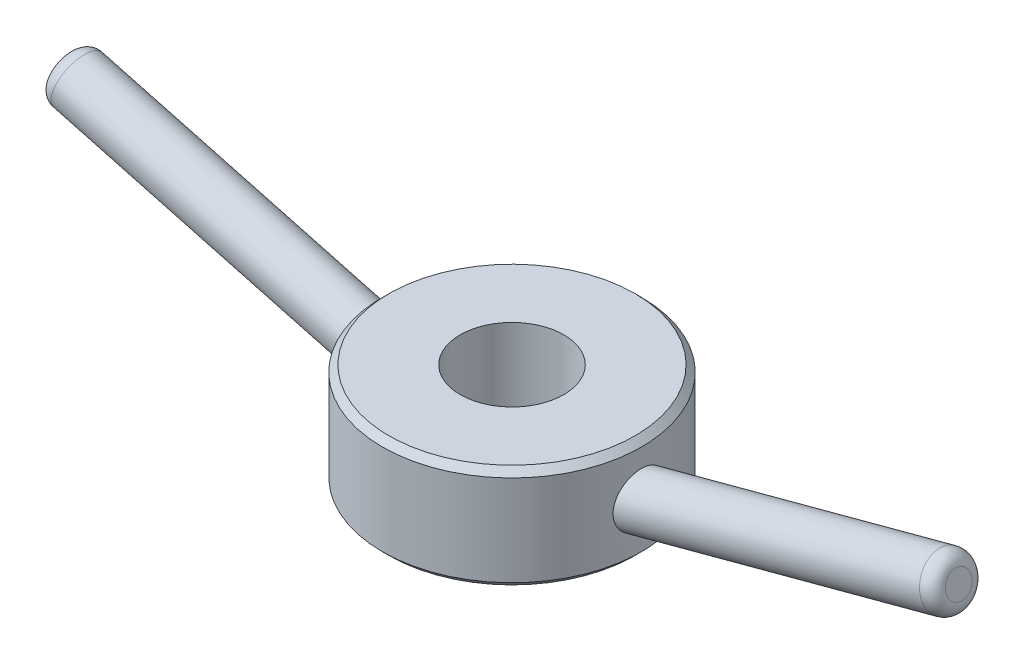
from build123d import *

# Parameters (mm, degrees)
SKETCH1_R            = 63.5
SKETCH1_R_2          = 25.4
BOSS_EXTRUDE1_DEPTH  = 25.4
SKETCH2_R            = 12.7
BOSS_EXTRUDE2_DEPTH  = 177.8
FILLET1_R            = 6.35
FILLET1_OF_MIRROR1_R = 6.35
CHAMFER1_SIZE        = 3.175


with BuildPart() as part:
    # Sketch1 → Boss-Extrude1 (new, symmetric)
    with BuildSketch(Plane(origin=(0, 0, 0), x_dir=(1, 0, 0), z_dir=(0, 1, 0))):
        with Locations(Location((0, 0, 0), (0, 0, 270))):
            Circle(SKETCH1_R)
        with Locations(Location((0, 0, 0), (0, 0, 270))):
            Circle(SKETCH1_R_2, mode=Mode.SUBTRACT)
    extrude(amount=BOSS_EXTRUDE1_DEPTH, both=True)

    # Sketch2 → Boss-Extrude2 (add)
    with BuildSketch(Plane(origin=(42.935402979, 11.504506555, 0), x_dir=(0, 0, -1), z_dir=(0.9659258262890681, 0.25881904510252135, 0))):
        with Locations(Location((0, -16.435009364, 0), (0, 0, 270))):
            Circle(SKETCH2_R)
    boss_extrude2 = extrude(amount=BOSS_EXTRUDE2_DEPTH)

    # Fillet1
    fillet1_edges = [part.edges().sort_by_distance(p)[0] for p in [
        (215.64370645, 53.914790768, 0),
    ]]
    fillet(fillet1_edges, radius=FILLET1_R)

    # Mirror1: Boss-Extrude2 across plane
    add(boss_extrude2.mirror(Plane(origin=(0, 0, 0), x_dir=(0, 0, 1), z_dir=(1, 0, 0))))

    # Fillet1 of Mirror1
    fillet1_of_mirror1_edges = [part.edges().sort_by_distance(p)[0] for p in [
        (-215.64370645, 53.914790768, 0),
    ]]
    fillet(fillet1_of_mirror1_edges, radius=FILLET1_OF_MIRROR1_R)

    # Chamfer1
    chamfer1_edges = [part.edges().sort_by_distance(p)[0] for p in [
        (0, -25.4, -63.5),
        (0, 25.4, -63.5),
    ]]
    chamfer(chamfer1_edges, length=CHAMFER1_SIZE)


solid = part.part
